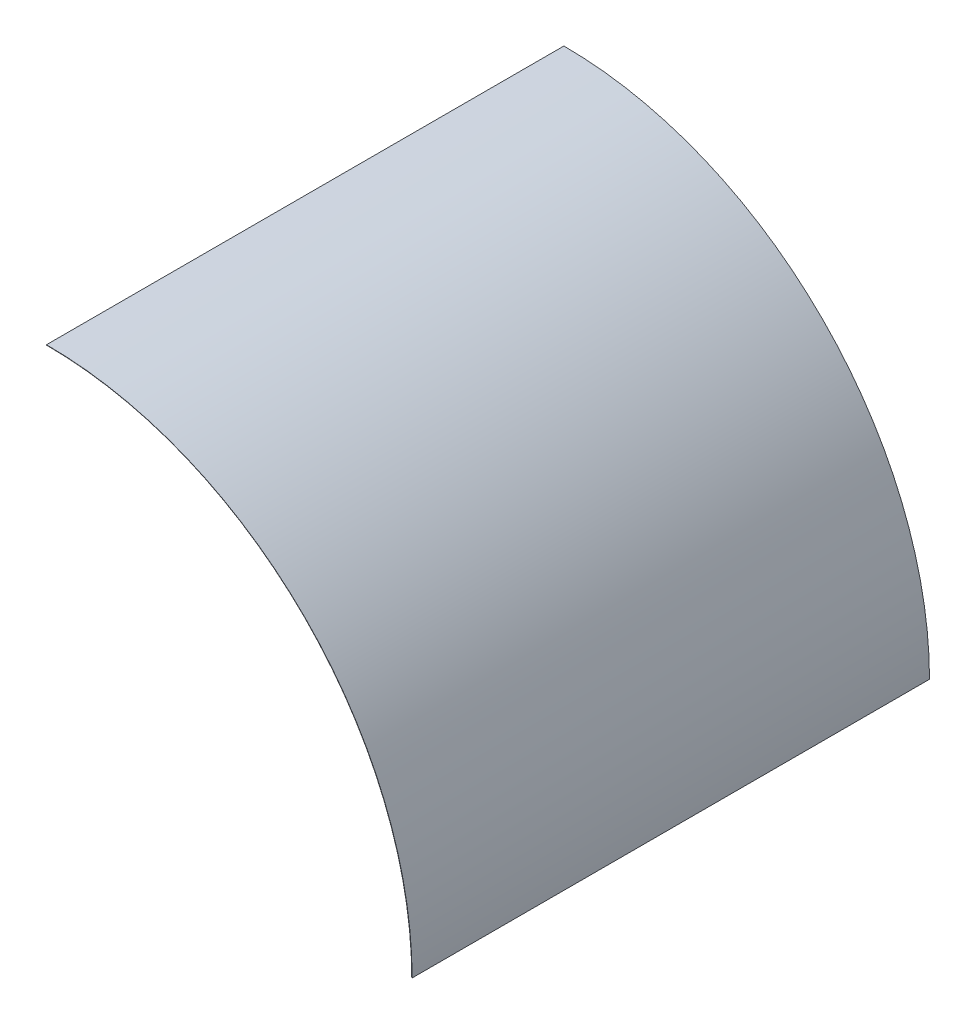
ISO-10303-21;
HEADER;
FILE_DESCRIPTION(('STEP AP214'),'2;1');
FILE_NAME('part.step','',(''),(''),'','','');
FILE_SCHEMA(('AUTOMOTIVE_DESIGN { 1 0 10303 214 1 1 1 1 }'));
ENDSEC;
DATA;
#1=APPLICATION_CONTEXT('core data for automotive mechanical design processes');
#2=APPLICATION_PROTOCOL_DEFINITION('international standard','automotive_design',2000,#1);
#3=PRODUCT_CONTEXT('',#1,'mechanical');
#4=PRODUCT('Part','Part','',(#3));
#5=PRODUCT_RELATED_PRODUCT_CATEGORY('part','',(#4));
#6=PRODUCT_DEFINITION_FORMATION('','',#4);
#7=PRODUCT_DEFINITION_CONTEXT('part definition',#1,'design');
#8=PRODUCT_DEFINITION('design','',#6,#7);
#9=PRODUCT_DEFINITION_SHAPE('','',#8);
#10=(LENGTH_UNIT() NAMED_UNIT(*) SI_UNIT(.MILLI.,.METRE.));
#11=(NAMED_UNIT(*) PLANE_ANGLE_UNIT() SI_UNIT($,.RADIAN.));
#12=(NAMED_UNIT(*) SI_UNIT($,.STERADIAN.) SOLID_ANGLE_UNIT());
#13=UNCERTAINTY_MEASURE_WITH_UNIT(LENGTH_MEASURE(1.E-05),#10,'distance_accuracy_value','');
#14=(GEOMETRIC_REPRESENTATION_CONTEXT(3) GLOBAL_UNCERTAINTY_ASSIGNED_CONTEXT((#13)) GLOBAL_UNIT_ASSIGNED_CONTEXT((#10,
#11,#12)) REPRESENTATION_CONTEXT('',''));
#15=CARTESIAN_POINT('',(0.,0.,0.));
#16=DIRECTION('',(0.,0.,1.));
#17=DIRECTION('',(1.,0.,0.));
#18=AXIS2_PLACEMENT_3D('',#15,#16,#17);
#19=CARTESIAN_POINT('',(0.,0.,-3000.));
#20=DIRECTION('',(0.,0.,1.));
#21=DIRECTION('',(1.,0.,0.));
#22=AXIS2_PLACEMENT_3D('',#19,#20,#21);
#23=CYLINDRICAL_SURFACE('',#22,2118.);
#24=CARTESIAN_POINT('',(0.,0.,0.));
#25=DIRECTION('',(0.,0.,-1.));
#26=DIRECTION('',(-1.,0.,0.));
#27=AXIS2_PLACEMENT_3D('',#24,#25,#26);
#28=CIRCLE('',#27,2118.);
#29=CARTESIAN_POINT('',(0.,2118.,0.));
#30=VERTEX_POINT('',#29);
#31=CARTESIAN_POINT('',(2118.,0.,0.));
#32=VERTEX_POINT('',#31);
#33=EDGE_CURVE('E97',#30,#32,#28,.T.);
#34=ORIENTED_EDGE('',*,*,#33,.F.);
#35=DIRECTION('',(0.,0.,1.));
#36=VECTOR('',#35,1.);
#37=CARTESIAN_POINT('',(0.,2118.,-3000.));
#38=LINE('',#37,#36);
#39=CARTESIAN_POINT('',(0.,2118.,-3000.));
#40=VERTEX_POINT('',#39);
#41=EDGE_CURVE('E11',#40,#30,#38,.T.);
#42=ORIENTED_EDGE('',*,*,#41,.F.);
#43=CARTESIAN_POINT('',(0.,0.,-3000.));
#44=DIRECTION('',(0.,0.,-1.));
#45=DIRECTION('',(-1.,0.,0.));
#46=AXIS2_PLACEMENT_3D('',#43,#44,#45);
#47=CIRCLE('',#46,2118.);
#48=CARTESIAN_POINT('',(2118.,0.,-3000.));
#49=VERTEX_POINT('',#48);
#50=EDGE_CURVE('E91',#40,#49,#47,.T.);
#51=ORIENTED_EDGE('',*,*,#50,.T.);
#52=DIRECTION('',(0.,0.,1.));
#53=VECTOR('',#52,1.);
#54=CARTESIAN_POINT('',(2118.,0.,-3000.));
#55=LINE('',#54,#53);
#56=EDGE_CURVE('E36',#49,#32,#55,.T.);
#57=ORIENTED_EDGE('',*,*,#56,.T.);
#58=EDGE_LOOP('',(#34,#42,#51,#57));
#59=FACE_BOUND('',#58,.T.);
#60=ADVANCED_FACE('F33',(#59),#23,.F.);
#61=CARTESIAN_POINT('',(0.,2120.,-3000.));
#62=DIRECTION('',(-1.,0.,0.));
#63=DIRECTION('',(0.,0.,1.));
#64=AXIS2_PLACEMENT_3D('',#61,#62,#63);
#65=PLANE('',#64);
#66=DIRECTION('',(0.,-1.,0.));
#67=VECTOR('',#66,1.);
#68=CARTESIAN_POINT('',(0.,2120.,0.));
#69=LINE('',#68,#67);
#70=CARTESIAN_POINT('',(0.,2120.,0.));
#71=VERTEX_POINT('',#70);
#72=EDGE_CURVE('E93',#71,#30,#69,.T.);
#73=ORIENTED_EDGE('',*,*,#72,.F.);
#74=DIRECTION('',(0.,0.,1.));
#75=VECTOR('',#74,1.);
#76=CARTESIAN_POINT('',(0.,2120.,-3000.));
#77=LINE('',#76,#75);
#78=CARTESIAN_POINT('',(0.,2120.,-3000.));
#79=VERTEX_POINT('',#78);
#80=EDGE_CURVE('E42',#79,#71,#77,.T.);
#81=ORIENTED_EDGE('',*,*,#80,.F.);
#82=DIRECTION('',(0.,-1.,0.));
#83=VECTOR('',#82,1.);
#84=CARTESIAN_POINT('',(0.,2120.,-3000.));
#85=LINE('',#84,#83);
#86=EDGE_CURVE('E88',#79,#40,#85,.T.);
#87=ORIENTED_EDGE('',*,*,#86,.T.);
#88=ORIENTED_EDGE('',*,*,#41,.T.);
#89=EDGE_LOOP('',(#73,#81,#87,#88));
#90=FACE_BOUND('',#89,.T.);
#91=ADVANCED_FACE('F107',(#90),#65,.T.);
#92=CARTESIAN_POINT('',(0.,0.,-3000.));
#93=DIRECTION('',(0.,0.,1.));
#94=DIRECTION('',(1.,0.,0.));
#95=AXIS2_PLACEMENT_3D('',#92,#93,#94);
#96=CYLINDRICAL_SURFACE('',#95,2120.);
#97=CARTESIAN_POINT('',(0.,0.,0.));
#98=DIRECTION('',(0.,0.,1.));
#99=DIRECTION('',(-1.,0.,0.));
#100=AXIS2_PLACEMENT_3D('',#97,#98,#99);
#101=CIRCLE('',#100,2120.);
#102=CARTESIAN_POINT('',(2120.,2.59625121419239E-13,0.));
#103=VERTEX_POINT('',#102);
#104=EDGE_CURVE('E83',#103,#71,#101,.T.);
#105=ORIENTED_EDGE('',*,*,#104,.F.);
#106=DIRECTION('',(0.,0.,1.));
#107=VECTOR('',#106,1.);
#108=CARTESIAN_POINT('',(2120.,2.59625121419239E-13,-3000.));
#109=LINE('',#108,#107);
#110=CARTESIAN_POINT('',(2120.,2.59625121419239E-13,-3000.));
#111=VERTEX_POINT('',#110);
#112=EDGE_CURVE('E78',#111,#103,#109,.T.);
#113=ORIENTED_EDGE('',*,*,#112,.F.);
#114=CARTESIAN_POINT('',(0.,0.,-3000.));
#115=DIRECTION('',(0.,0.,1.));
#116=DIRECTION('',(-1.,0.,0.));
#117=AXIS2_PLACEMENT_3D('',#114,#115,#116);
#118=CIRCLE('',#117,2120.);
#119=EDGE_CURVE('E81',#111,#79,#118,.T.);
#120=ORIENTED_EDGE('',*,*,#119,.T.);
#121=ORIENTED_EDGE('',*,*,#80,.T.);
#122=EDGE_LOOP('',(#105,#113,#120,#121));
#123=FACE_BOUND('',#122,.T.);
#124=ADVANCED_FACE('F80',(#123),#96,.T.);
#125=CARTESIAN_POINT('',(2120.,0.,-3000.));
#126=DIRECTION('',(0.,-1.,0.));
#127=DIRECTION('',(0.,0.,-1.));
#128=AXIS2_PLACEMENT_3D('',#125,#126,#127);
#129=PLANE('',#128);
#130=DIRECTION('',(1.,0.,0.));
#131=VECTOR('',#130,1.);
#132=CARTESIAN_POINT('',(2120.,0.,0.));
#133=LINE('',#132,#131);
#134=EDGE_CURVE('E100',#32,#103,#133,.T.);
#135=ORIENTED_EDGE('',*,*,#134,.F.);
#136=ORIENTED_EDGE('',*,*,#56,.F.);
#137=DIRECTION('',(1.,0.,0.));
#138=VECTOR('',#137,1.);
#139=CARTESIAN_POINT('',(2120.,0.,-3000.));
#140=LINE('',#139,#138);
#141=EDGE_CURVE('E87',#49,#111,#140,.T.);
#142=ORIENTED_EDGE('',*,*,#141,.T.);
#143=ORIENTED_EDGE('',*,*,#112,.T.);
#144=EDGE_LOOP('',(#135,#136,#142,#143));
#145=FACE_BOUND('',#144,.T.);
#146=ADVANCED_FACE('F90',(#145),#129,.T.);
#147=CARTESIAN_POINT('',(0.,0.,-3000.));
#148=DIRECTION('',(0.,0.,-1.));
#149=DIRECTION('',(-1.,0.,0.));
#150=AXIS2_PLACEMENT_3D('',#147,#148,#149);
#151=PLANE('',#150);
#152=ORIENTED_EDGE('',*,*,#50,.F.);
#153=ORIENTED_EDGE('',*,*,#86,.F.);
#154=ORIENTED_EDGE('',*,*,#119,.F.);
#155=ORIENTED_EDGE('',*,*,#141,.F.);
#156=EDGE_LOOP('',(#152,#153,#154,#155));
#157=FACE_BOUND('',#156,.T.);
#158=ADVANCED_FACE('F86',(#157),#151,.T.);
#159=CARTESIAN_POINT('',(0.,0.,0.));
#160=DIRECTION('',(0.,0.,-1.));
#161=DIRECTION('',(-1.,0.,0.));
#162=AXIS2_PLACEMENT_3D('',#159,#160,#161);
#163=PLANE('',#162);
#164=ORIENTED_EDGE('',*,*,#33,.T.);
#165=ORIENTED_EDGE('',*,*,#134,.T.);
#166=ORIENTED_EDGE('',*,*,#104,.T.);
#167=ORIENTED_EDGE('',*,*,#72,.T.);
#168=EDGE_LOOP('',(#164,#165,#166,#167));
#169=FACE_BOUND('',#168,.T.);
#170=ADVANCED_FACE('F106',(#169),#163,.F.);
#171=CLOSED_SHELL('',(#60,#91,#124,#146,#158,#170));
#172=MANIFOLD_SOLID_BREP('B2',#171);
#173=ADVANCED_BREP_SHAPE_REPRESENTATION('',(#18,#172),#14);
#174=SHAPE_DEFINITION_REPRESENTATION(#9,#173);
ENDSEC;
END-ISO-10303-21;
